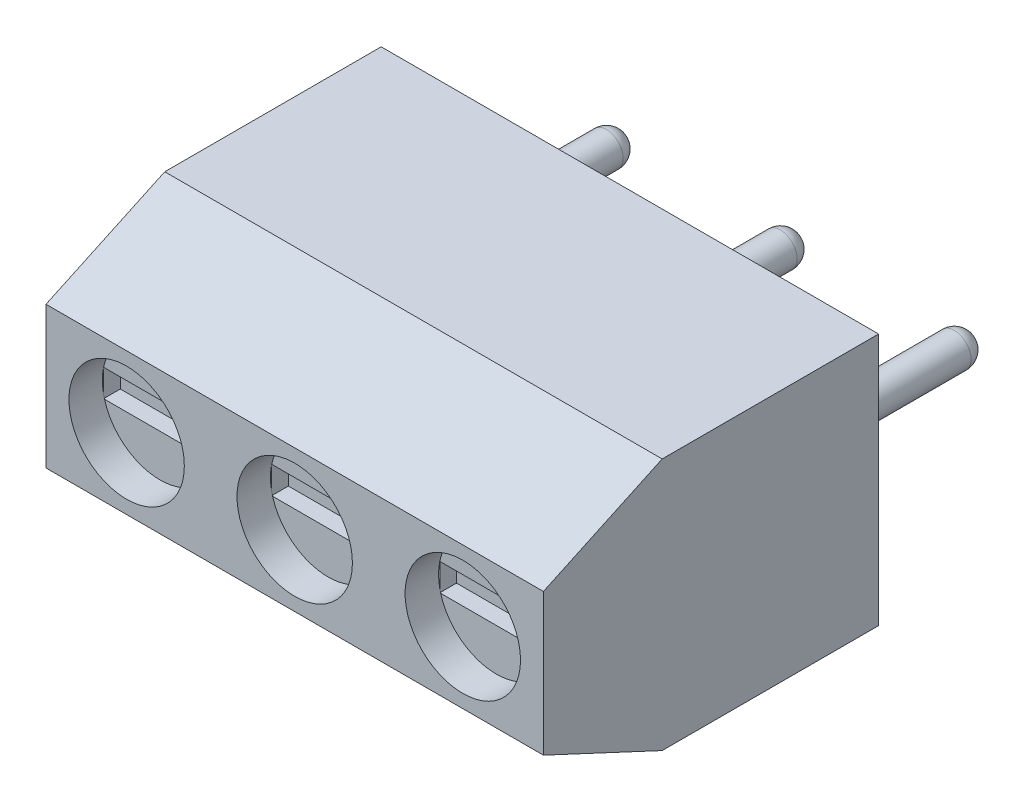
from build123d import *
from OCP.BRepFilletAPI import BRepFilletAPI_MakeChamfer

# Parameters (mm, degrees)
ESQUISSE1_W             = 14.87
ESQUISSE1_H             = 7.55
EXTRUSION1_DEPTH        = 10.02
CHANFREIN1_SIZE         = 3.55
CHANFREIN1_SIZE2        = 1.655392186
ESQUISSE2_R             = 1.725
ENL_V_MAT_EXTRU_1_DEPTH = 1
ESQUISSE3_W             = 4
ESQUISSE3_H             = 5
ENL_V_MAT_EXTRU_2_DEPTH = 1.6
ESQUISSE4_R             = 1.675
ENL_V_MAT_EXTRU_3_DEPTH = 1.6
ESQUISSE5_R             = 0.5
EXTRUSION2_DEPTH        = 5
CONG_1_R                = 0.5
ESQUISSE7_W             = 3.350516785
ESQUISSE7_H             = 0.814037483
ESQUISSE7_W_2           = 3.350516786
ENL_V_MAT_EXTRU_4_DEPTH = 0.5
ESQUISSE8_W             = 3.1960084
ESQUISSE8_H             = 1.003036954
ESQUISSE8_W_2           = 1.098372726
ESQUISSE8_H_2           = 3.164818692
ENL_V_MAT_EXTRU_5_DEPTH = 0.5


with BuildPart() as part:
    # Esquisse1 → Extrusion1 (new body)
    with BuildSketch(Plane.XY):
        with Locations((7.435, 3.775)):
            Rectangle(ESQUISSE1_W, ESQUISSE1_H)
    extrude(amount=EXTRUSION1_DEPTH)

    # Chanfrein1: one chamfer whose edges measure the first distance from different faces: ONE call of the kernel's chamfer builder (chamfer() names one face for all edges)
    chanfrein1_edges_1 = [part.edges().sort_by_distance(p)[0] for p in [
        (7.435, 7.55, 10.02),
    ]]
    chanfrein1_side_1 = [part.faces().sort_by_distance(p)[0] for p in [
        (7.435, 7.55, 5.01),
    ]]
    chanfrein1_edges_2 = [part.edges().sort_by_distance(p)[0] for p in [
        (7.435, 0, 10.02),
    ]]
    chanfrein1_side_2 = [part.faces().sort_by_distance(p)[0] for p in [
        (7.435, 0, 5.01),
    ]]
    chanfrein1 = BRepFilletAPI_MakeChamfer(part.part.solid().wrapped)
    for e in chanfrein1_edges_1:
        chanfrein1.Add(CHANFREIN1_SIZE, CHANFREIN1_SIZE2, e.wrapped, chanfrein1_side_1[0].wrapped)  # the first distance lies on this face
    for e in chanfrein1_edges_2:
        chanfrein1.Add(CHANFREIN1_SIZE, CHANFREIN1_SIZE2, e.wrapped, chanfrein1_side_2[0].wrapped)  # the first distance lies on this face
    add(Compound.cast(chanfrein1.Shape()), mode=Mode.REPLACE)

    # Esquisse2 → Enl_v. mat.-Extru.1 (cut)
    with BuildSketch(Plane.XY.offset(10.02)):
        with Locations((2.410120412, 3.775)):
            Circle(ESQUISSE2_R)
        with Locations((12.459879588, 3.775)):
            Circle(ESQUISSE2_R)
        with Locations((7.435, 3.775)):
            Circle(ESQUISSE2_R)
    extrude(amount=-ENL_V_MAT_EXTRU_1_DEPTH, mode=Mode.SUBTRACT)

    # Esquisse3 → Enl_v. mat.-Extru.2 (cut)
    with BuildSketch(Plane.XZ):
        with Locations((7.44, 3.3)):
            Rectangle(ESQUISSE3_W, ESQUISSE3_H)
        with Locations((2.54, 3.3)):
            Rectangle(ESQUISSE3_W, ESQUISSE3_H)
        with Locations((12.34, 3.3)):
            Rectangle(ESQUISSE3_W, ESQUISSE3_H)
    extrude(amount=-ENL_V_MAT_EXTRU_2_DEPTH, mode=Mode.SUBTRACT)

    # Esquisse4 → Enl_v. mat.-Extru.3 (cut)
    with BuildSketch(Plane.XZ.offset(-1.6)):
        with Locations(Location((7.44, 3.235, 0), (0, 0, 270))):
            Circle(ESQUISSE4_R)
        with Locations(Location((2.535, 3.235, 0), (0, 0, 270))):
            Circle(ESQUISSE4_R)
        with Locations(Location((12.34, 3.235, 0), (0, 0, 270))):
            Circle(ESQUISSE4_R)
    extrude(amount=-ENL_V_MAT_EXTRU_3_DEPTH, mode=Mode.SUBTRACT)

    # Esquisse5 → Extrusion2 (add)
    with BuildSketch(Plane(origin=(0, 0, 0), x_dir=(-1, 0, 0), z_dir=(0, 0, -1))):
        with Locations((-7.435, 3.775)):
            Circle(ESQUISSE5_R)
        with Locations((-2.235, 3.775)):
            Circle(ESQUISSE5_R)
        with Locations((-12.635, 3.775)):
            Circle(ESQUISSE5_R)
    extrude(amount=EXTRUSION2_DEPTH)

    # Cong_1
    cong_1_edges = [part.edges().sort_by_distance(p)[0] for p in [
        (7.935, 3.775, -5),
        (2.735, 3.775, -5),
        (13.135, 3.775, -5),
    ]]
    fillet(cong_1_edges, radius=CONG_1_R)

    # Esquisse7 → Enl_v. mat.-Extru.4 (cut)
    with BuildSketch(Plane.XY.offset(9.02)):
        with Locations((2.396212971, 3.717758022)):
            Rectangle(ESQUISSE7_W, ESQUISSE7_H)
        with Locations((7.421092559, 3.717758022)):
            Rectangle(ESQUISSE7_W_2, ESQUISSE7_H)
        with Locations((12.445972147, 3.717758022)):
            Rectangle(ESQUISSE7_W_2, ESQUISSE7_H)
    extrude(amount=-ENL_V_MAT_EXTRU_4_DEPTH, mode=Mode.SUBTRACT)

    # Esquisse8 → Enl_v. mat.-Extru.5 (cut)
    with BuildSketch(Plane.XZ.offset(-3.2)):
        with Locations((2.54160667, 3.256051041)):
            Rectangle(ESQUISSE8_W, ESQUISSE8_H)
        with Locations((7.44, 3.235)):
            Rectangle(ESQUISSE8_W_2, ESQUISSE8_H_2)
        with Locations((12.34660667, 3.256051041)):
            Rectangle(ESQUISSE8_W, ESQUISSE8_H)
    extrude(amount=-ENL_V_MAT_EXTRU_5_DEPTH, mode=Mode.SUBTRACT)


solid = part.part
